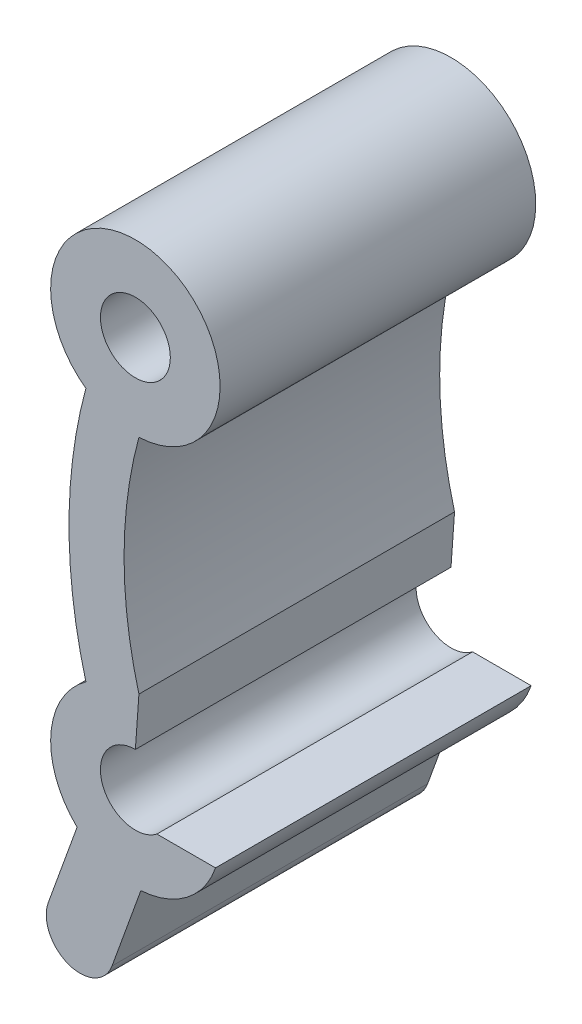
from build123d import *

# Parameters (mm, degrees)
SZKIC1_R                    = 1.650007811
DODANIE_WYCI_GNI_CIE1_DEPTH = 7.45


with BuildPart() as part:
    # Szkic1 → Dodanie-wyci_gni_cie1 (new, symmetric)
    with BuildSketch(Plane.XY):
        with BuildLine():
            Line((152.711114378, 44.750005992), (152.544315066, 42.403489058))
            ThreePointArc((152.544315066, 42.403489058), (150.984260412, 40.216121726), (153.560443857, 39.453478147))
            Line((153.560443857, 39.453478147), (156.327174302, 39.453478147))
            ThreePointArc((156.327174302, 39.453478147), (154.97184767, 37.574311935), (152.802058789, 36.761789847))
            Line((152.802058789, 36.761789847), (151.441615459, 33.000248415))
            ThreePointArc((151.441615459, 33.000248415), (149.392819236, 32.039809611), (148.43238293, 34.088607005))
            Line((148.43238293, 34.088607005), (149.792826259, 37.850148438))
            ThreePointArc((149.792826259, 37.850148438), (148.553378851, 41.02266553), (150.207627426, 44.000005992))
            ThreePointArc((150.207627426, 44.000005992), (149.411230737, 50.000005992), (150.207627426, 56.000005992))
            ThreePointArc((150.207627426, 56.000005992), (153.692238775, 63.078280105), (152.711114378, 55.250005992))
            ThreePointArc((152.711114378, 55.250005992), (152.009754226, 50.000005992), (152.711114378, 44.750005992))
        make_face()
        with Locations((152.544315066, 59.246530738)):
            Circle(SZKIC1_R, mode=Mode.SUBTRACT)
    extrude(amount=DODANIE_WYCI_GNI_CIE1_DEPTH, both=True)


solid = part.part
